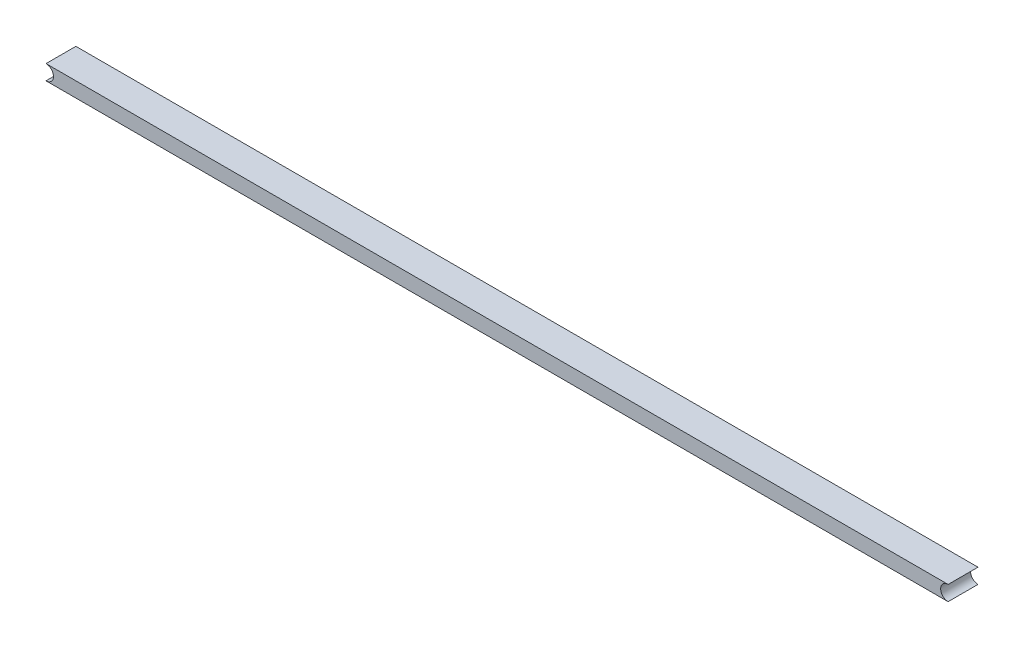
from build123d import *

# Parameters (mm, degrees)
ESQUISSE1_W             = 20
ESQUISSE1_H             = 10
BASE_EXTRUSION_DEPTH    = 302
ESQUISSE3_R             = 5
ENL_V_MAT_EXTRU_2_DEPTH = 303.826683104
ESQUISSE4_R             = 5
ENL_V_MAT_EXTRU_3_DEPTH = 303.826683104


with BuildPart() as part:
    # Esquisse1 → Base-Extrusion (new, symmetric)
    with BuildSketch(Plane(origin=(0, 0, 0), x_dir=(0, 0, -1), z_dir=(1, 0, 0))):
        with Locations((0, -5)):
            Rectangle(ESQUISSE1_W, ESQUISSE1_H)
    extrude(amount=BASE_EXTRUSION_DEPTH, both=True)

    # Esquisse3 → Enl_v. mat.-Extru.2 (cut, through all)
    with BuildSketch(Plane.XY.offset(10)):
        with Locations((-302, -5)):
            Circle(ESQUISSE3_R)
    extrude(amount=-ENL_V_MAT_EXTRU_2_DEPTH, mode=Mode.SUBTRACT)

    # Esquisse4 → Enl_v. mat.-Extru.3 (cut, through all)
    with BuildSketch(Plane.XY.offset(10)):
        with Locations((302, -5)):
            Circle(ESQUISSE4_R)
    extrude(amount=-ENL_V_MAT_EXTRU_3_DEPTH, mode=Mode.SUBTRACT)


solid = part.part
